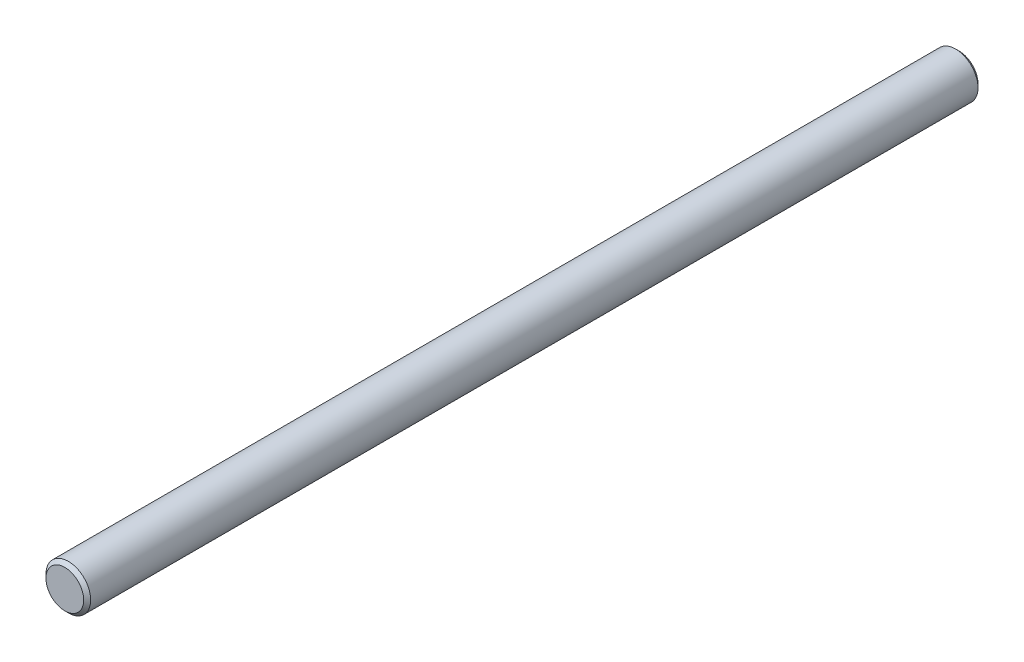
ISO-10303-21;
HEADER;
FILE_DESCRIPTION(('STEP AP214'),'2;1');
FILE_NAME('part.step','',(''),(''),'','','');
FILE_SCHEMA(('AUTOMOTIVE_DESIGN { 1 0 10303 214 1 1 1 1 }'));
ENDSEC;
DATA;
#1=APPLICATION_CONTEXT('core data for automotive mechanical design processes');
#2=APPLICATION_PROTOCOL_DEFINITION('international standard','automotive_design',2000,#1);
#3=PRODUCT_CONTEXT('',#1,'mechanical');
#4=PRODUCT('Part','Part','',(#3));
#5=PRODUCT_RELATED_PRODUCT_CATEGORY('part','',(#4));
#6=PRODUCT_DEFINITION_FORMATION('','',#4);
#7=PRODUCT_DEFINITION_CONTEXT('part definition',#1,'design');
#8=PRODUCT_DEFINITION('design','',#6,#7);
#9=PRODUCT_DEFINITION_SHAPE('','',#8);
#10=(LENGTH_UNIT() NAMED_UNIT(*) SI_UNIT(.MILLI.,.METRE.));
#11=(NAMED_UNIT(*) PLANE_ANGLE_UNIT() SI_UNIT($,.RADIAN.));
#12=(NAMED_UNIT(*) SI_UNIT($,.STERADIAN.) SOLID_ANGLE_UNIT());
#13=UNCERTAINTY_MEASURE_WITH_UNIT(LENGTH_MEASURE(1.E-05),#10,'distance_accuracy_value','');
#14=(GEOMETRIC_REPRESENTATION_CONTEXT(3) GLOBAL_UNCERTAINTY_ASSIGNED_CONTEXT((#13)) GLOBAL_UNIT_ASSIGNED_CONTEXT((#10,
#11,#12)) REPRESENTATION_CONTEXT('',''));
#15=CARTESIAN_POINT('',(0.,0.,0.));
#16=DIRECTION('',(0.,0.,1.));
#17=DIRECTION('',(1.,0.,0.));
#18=AXIS2_PLACEMENT_3D('',#15,#16,#17);
#19=CARTESIAN_POINT('',(-1.11022302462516E-13,-1.11022302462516E-13,-160.));
#20=DIRECTION('',(0.,0.,1.));
#21=DIRECTION('',(0.999999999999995,0.,0.));
#22=AXIS2_PLACEMENT_3D('',#19,#20,#21);
#23=CYLINDRICAL_SURFACE('',#22,4.);
#24=CARTESIAN_POINT('',(0.,0.,-0.625000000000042));
#25=DIRECTION('',(0.,0.,1.));
#26=DIRECTION('',(0.999999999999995,0.,0.));
#27=AXIS2_PLACEMENT_3D('',#24,#25,#26);
#28=CIRCLE('',#27,4.);
#29=CARTESIAN_POINT('',(3.99999999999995,0.,-0.625000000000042));
#30=VERTEX_POINT('',#29);
#31=EDGE_CURVE('E10',#30,#30,#28,.F.);
#32=ORIENTED_EDGE('',*,*,#31,.T.);
#33=EDGE_LOOP('',(#32));
#34=FACE_BOUND('',#33,.T.);
#35=CARTESIAN_POINT('',(-1.38777878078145E-13,-1.11022302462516E-13,-159.375));
#36=DIRECTION('',(0.,0.,1.));
#37=DIRECTION('',(0.999999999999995,0.,0.));
#38=AXIS2_PLACEMENT_3D('',#35,#36,#37);
#39=CIRCLE('',#38,4.);
#40=CARTESIAN_POINT('',(3.99999999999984,-1.11142215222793E-13,-159.375));
#41=VERTEX_POINT('',#40);
#42=EDGE_CURVE('E42',#41,#41,#39,.T.);
#43=ORIENTED_EDGE('',*,*,#42,.T.);
#44=EDGE_LOOP('',(#43));
#45=FACE_BOUND('',#44,.T.);
#46=ADVANCED_FACE('F28',(#34,#45),#23,.T.);
#47=CARTESIAN_POINT('',(-1.11022302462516E-13,-1.11022302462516E-13,-160.));
#48=DIRECTION('',(0.,0.,1.));
#49=DIRECTION('',(0.999999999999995,0.,0.));
#50=AXIS2_PLACEMENT_3D('',#47,#48,#49);
#51=PLANE('',#50);
#52=CARTESIAN_POINT('',(-1.11022302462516E-13,-1.11022302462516E-13,-160.));
#53=DIRECTION('',(0.,0.,1.));
#54=DIRECTION('',(0.999999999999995,0.,0.));
#55=AXIS2_PLACEMENT_3D('',#52,#53,#54);
#56=CIRCLE('',#55,3.375);
#57=CARTESIAN_POINT('',(3.37499999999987,-1.11123478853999E-13,-160.));
#58=VERTEX_POINT('',#57);
#59=EDGE_CURVE('E38',#58,#58,#56,.F.);
#60=ORIENTED_EDGE('',*,*,#59,.T.);
#61=EDGE_LOOP('',(#60));
#62=FACE_BOUND('',#61,.T.);
#63=ADVANCED_FACE('F61',(#62),#51,.F.);
#64=CARTESIAN_POINT('',(0.,0.,0.));
#65=DIRECTION('',(0.,0.,1.));
#66=DIRECTION('',(0.999999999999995,0.,0.));
#67=AXIS2_PLACEMENT_3D('',#64,#65,#66);
#68=PLANE('',#67);
#69=CARTESIAN_POINT('',(0.,0.,0.));
#70=DIRECTION('',(0.,0.,1.));
#71=DIRECTION('',(0.999999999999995,0.,0.));
#72=AXIS2_PLACEMENT_3D('',#69,#70,#71);
#73=CIRCLE('',#72,3.375);
#74=CARTESIAN_POINT('',(3.37499999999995,0.,0.));
#75=VERTEX_POINT('',#74);
#76=EDGE_CURVE('E34',#75,#75,#73,.T.);
#77=ORIENTED_EDGE('',*,*,#76,.T.);
#78=EDGE_LOOP('',(#77));
#79=FACE_BOUND('',#78,.T.);
#80=ADVANCED_FACE('F52',(#79),#68,.T.);
#81=CARTESIAN_POINT('',(-1.38777878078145E-13,-1.11022302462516E-13,-159.375));
#82=DIRECTION('',(0.,0.,1.));
#83=DIRECTION('',(0.999999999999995,0.,0.));
#84=AXIS2_PLACEMENT_3D('',#81,#82,#83);
#85=CONICAL_SURFACE('',#84,4.,0.785398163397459);
#86=ORIENTED_EDGE('',*,*,#59,.F.);
#87=EDGE_LOOP('',(#86));
#88=FACE_BOUND('',#87,.T.);
#89=ORIENTED_EDGE('',*,*,#42,.F.);
#90=EDGE_LOOP('',(#89));
#91=FACE_BOUND('',#90,.T.);
#92=ADVANCED_FACE('F49',(#88,#91),#85,.T.);
#93=CARTESIAN_POINT('',(0.,0.,0.));
#94=DIRECTION('',(0.,0.,-1.));
#95=DIRECTION('',(-0.999999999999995,0.,0.));
#96=AXIS2_PLACEMENT_3D('',#93,#94,#95);
#97=CONICAL_SURFACE('',#96,3.375,0.785398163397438);
#98=ORIENTED_EDGE('',*,*,#31,.F.);
#99=EDGE_LOOP('',(#98));
#100=FACE_BOUND('',#99,.T.);
#101=ORIENTED_EDGE('',*,*,#76,.F.);
#102=EDGE_LOOP('',(#101));
#103=FACE_BOUND('',#102,.T.);
#104=ADVANCED_FACE('F51',(#100,#103),#97,.T.);
#105=CLOSED_SHELL('',(#46,#63,#80,#92,#104));
#106=MANIFOLD_SOLID_BREP('B2',#105);
#107=ADVANCED_BREP_SHAPE_REPRESENTATION('',(#18,#106),#14);
#108=SHAPE_DEFINITION_REPRESENTATION(#9,#107);
ENDSEC;
END-ISO-10303-21;
